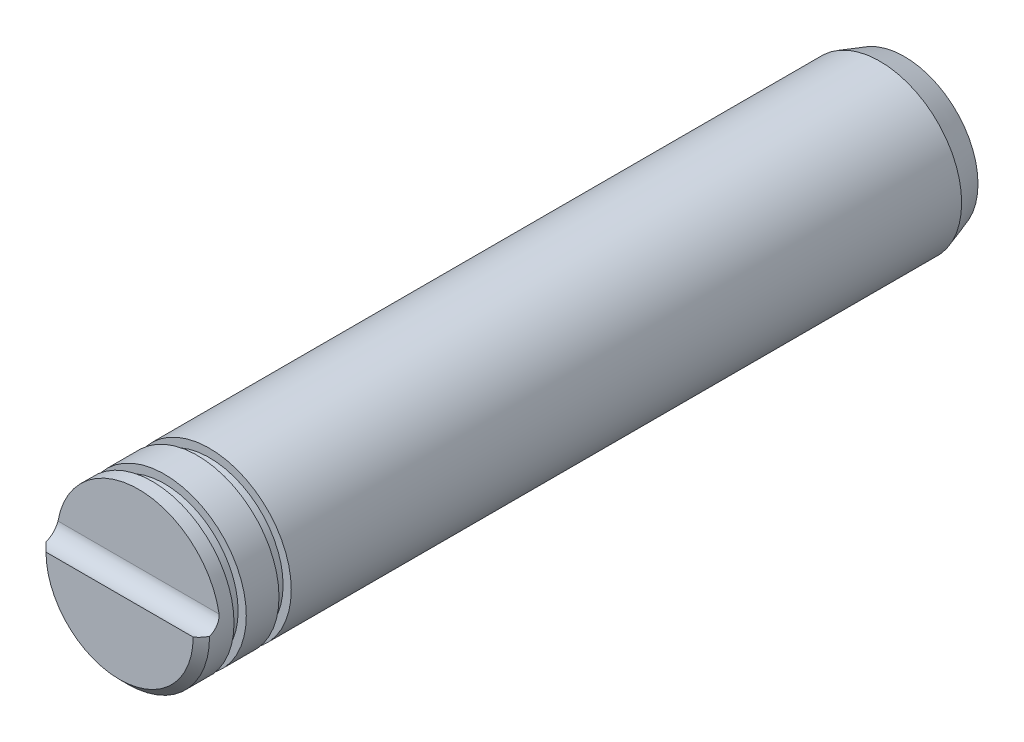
ISO-10303-21;
HEADER;
FILE_DESCRIPTION(('STEP AP214'),'2;1');
FILE_NAME('part.step','',(''),(''),'','','');
FILE_SCHEMA(('AUTOMOTIVE_DESIGN { 1 0 10303 214 1 1 1 1 }'));
ENDSEC;
DATA;
#1=APPLICATION_CONTEXT('core data for automotive mechanical design processes');
#2=APPLICATION_PROTOCOL_DEFINITION('international standard','automotive_design',2000,#1);
#3=PRODUCT_CONTEXT('',#1,'mechanical');
#4=PRODUCT('Part','Part','',(#3));
#5=PRODUCT_RELATED_PRODUCT_CATEGORY('part','',(#4));
#6=PRODUCT_DEFINITION_FORMATION('','',#4);
#7=PRODUCT_DEFINITION_CONTEXT('part definition',#1,'design');
#8=PRODUCT_DEFINITION('design','',#6,#7);
#9=PRODUCT_DEFINITION_SHAPE('','',#8);
#10=(LENGTH_UNIT() NAMED_UNIT(*) SI_UNIT(.MILLI.,.METRE.));
#11=(NAMED_UNIT(*) PLANE_ANGLE_UNIT() SI_UNIT($,.RADIAN.));
#12=(NAMED_UNIT(*) SI_UNIT($,.STERADIAN.) SOLID_ANGLE_UNIT());
#13=UNCERTAINTY_MEASURE_WITH_UNIT(LENGTH_MEASURE(1.E-05),#10,'distance_accuracy_value','');
#14=(GEOMETRIC_REPRESENTATION_CONTEXT(3) GLOBAL_UNCERTAINTY_ASSIGNED_CONTEXT((#13)) GLOBAL_UNIT_ASSIGNED_CONTEXT((#10,
#11,#12)) REPRESENTATION_CONTEXT('',''));
#15=CARTESIAN_POINT('',(0.,0.,0.));
#16=DIRECTION('',(0.,0.,1.));
#17=DIRECTION('',(1.,0.,0.));
#18=AXIS2_PLACEMENT_3D('',#15,#16,#17);
#19=CARTESIAN_POINT('',(0.,0.,96.));
#20=DIRECTION('',(0.,0.,-1.));
#21=DIRECTION('',(-1.,0.,0.));
#22=AXIS2_PLACEMENT_3D('',#19,#20,#21);
#23=CYLINDRICAL_SURFACE('',#22,10.);
#24=CARTESIAN_POINT('',(0.,0.,92.));
#25=DIRECTION('',(0.,0.,1.));
#26=DIRECTION('',(1.,0.,0.));
#27=AXIS2_PLACEMENT_3D('',#24,#25,#26);
#28=CIRCLE('',#27,10.);
#29=CARTESIAN_POINT('',(10.,0.,92.));
#30=VERTEX_POINT('',#29);
#31=EDGE_CURVE('E176',#30,#30,#28,.T.);
#32=ORIENTED_EDGE('',*,*,#31,.T.);
#33=EDGE_LOOP('',(#32));
#34=FACE_BOUND('',#33,.T.);
#35=CARTESIAN_POINT('',(9.99965835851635,0.0826602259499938,95.));
#36=CARTESIAN_POINT('',(9.99950345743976,0.101144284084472,94.9470807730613));
#37=CARTESIAN_POINT('',(9.99928327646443,0.121844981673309,94.8949641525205));
#38=CARTESIAN_POINT('',(9.99862297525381,0.167543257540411,94.7926531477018));
#39=CARTESIAN_POINT('',(9.99818286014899,0.192540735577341,94.7424587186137));
#40=CARTESIAN_POINT('',(9.99640009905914,0.27370415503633,94.5953593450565));
#41=CARTESIAN_POINT('',(9.99459509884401,0.336090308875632,94.5017978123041));
#42=CARTESIAN_POINT('',(9.9889265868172,0.475612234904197,94.326452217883));
#43=CARTESIAN_POINT('',(9.98506174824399,0.552757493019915,94.2446757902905));
#44=CARTESIAN_POINT('',(9.97443066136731,0.719509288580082,94.095268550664));
#45=CARTESIAN_POINT('',(9.96766545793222,0.809111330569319,94.0276326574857));
#46=CARTESIAN_POINT('',(9.95056303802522,0.997591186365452,93.9087143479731));
#47=CARTESIAN_POINT('',(9.94024517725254,1.09641666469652,93.8573461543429));
#48=CARTESIAN_POINT('',(9.91557002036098,1.30079063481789,93.7718040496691));
#49=CARTESIAN_POINT('',(9.9012121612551,1.4063400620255,93.7376325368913));
#50=CARTESIAN_POINT('',(9.86836964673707,1.62080961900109,93.6872784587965));
#51=CARTESIAN_POINT('',(9.8498924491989,1.72972335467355,93.6710636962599));
#52=CARTESIAN_POINT('',(9.80905882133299,1.9479980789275,93.6566306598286));
#53=CARTESIAN_POINT('',(9.786702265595,2.05735908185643,93.658412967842));
#54=CARTESIAN_POINT('',(9.73822505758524,2.27590972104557,93.6797889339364));
#55=CARTESIAN_POINT('',(9.71203489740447,2.3850469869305,93.6997578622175));
#56=CARTESIAN_POINT('',(9.65725468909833,2.59798631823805,93.7571746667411));
#57=CARTESIAN_POINT('',(9.62866419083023,2.70178737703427,93.7946258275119));
#58=CARTESIAN_POINT('',(9.56920836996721,2.90550304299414,93.8876676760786));
#59=CARTESIAN_POINT('',(9.53829781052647,3.00510679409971,93.9439106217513));
#60=CARTESIAN_POINT('',(9.47690107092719,3.19345848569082,94.0726303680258));
#61=CARTESIAN_POINT('',(9.44641517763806,3.28219937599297,94.1451176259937));
#62=CARTESIAN_POINT('',(9.38715749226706,3.44807134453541,94.3062295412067));
#63=CARTESIAN_POINT('',(9.35843278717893,3.52493157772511,94.3951506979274));
#64=CARTESIAN_POINT('',(9.30554160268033,3.66228345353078,94.5858854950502));
#65=CARTESIAN_POINT('',(9.28136483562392,3.7228121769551,94.6876691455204));
#66=CARTESIAN_POINT('',(9.25396996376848,3.79003126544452,94.827759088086));
#67=CARTESIAN_POINT('',(9.24776685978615,3.80513392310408,94.8616174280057));
#68=CARTESIAN_POINT('',(9.23606320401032,3.83345404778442,94.9301823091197));
#69=CARTESIAN_POINT('',(9.23056180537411,3.84667378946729,94.9648877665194));
#70=CARTESIAN_POINT('',(9.22543123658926,3.85894007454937,95.));
#71=B_SPLINE_CURVE_WITH_KNOTS('',3,(#35,#36,#37,#38,#39,#40,#41,#42,#43,#44,#45,#46,#47,#48,#49,
#50,#51,#52,#53,#54,#55,#56,#57,#58,#59,#60,#61,#62,#63,#64,#65,#66,#67,#68,#69,#70),
.UNSPECIFIED.,.F.,.F.,(4,2,2,2,2,2,2,2,2,2,2,2,2,2,2,2,2,4),(0.,0.168061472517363,
0.336119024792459,0.671793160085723,1.00768376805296,1.3434534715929,1.6774220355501,
2.01143716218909,2.34485241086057,2.67827844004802,3.01874434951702,3.35927425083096,
3.71312464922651,4.06720349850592,4.42843746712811,4.78884421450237,4.90156581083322,
5.01415005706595),.UNSPECIFIED.);
#72=CARTESIAN_POINT('',(9.99965835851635,0.0826602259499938,95.));
#73=VERTEX_POINT('',#72);
#74=CARTESIAN_POINT('',(9.85494799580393,1.69705627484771,93.6783129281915));
#75=VERTEX_POINT('',#74);
#76=EDGE_CURVE('E96',#73,#75,#71,.T.);
#77=ORIENTED_EDGE('',*,*,#76,.F.);
#78=CARTESIAN_POINT('',(0.,0.,95.));
#79=DIRECTION('',(0.,0.,1.));
#80=DIRECTION('',(1.,0.,0.));
#81=AXIS2_PLACEMENT_3D('',#78,#79,#80);
#82=CIRCLE('',#81,10.);
#83=CARTESIAN_POINT('',(-9.99965835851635,0.0826602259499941,95.));
#84=VERTEX_POINT('',#83);
#85=EDGE_CURVE('E68',#73,#84,#82,.F.);
#86=ORIENTED_EDGE('',*,*,#85,.T.);
#87=CARTESIAN_POINT('',(-9.22543123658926,3.85894007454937,95.));
#88=CARTESIAN_POINT('',(-9.23324629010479,3.84025190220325,94.9464937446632));
#89=CARTESIAN_POINT('',(-9.24192946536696,3.81933894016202,94.8939300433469));
#90=CARTESIAN_POINT('',(-9.2608324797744,3.77327591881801,94.7910089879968));
#91=CARTESIAN_POINT('',(-9.27105160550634,3.74812782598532,94.7406506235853));
#92=CARTESIAN_POINT('',(-9.30364760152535,3.66681569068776,94.5936453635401));
#93=CARTESIAN_POINT('',(-9.32802217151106,3.60464629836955,94.5006790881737));
#94=CARTESIAN_POINT('',(-9.38023701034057,3.46649494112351,94.3271226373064));
#95=CARTESIAN_POINT('',(-9.40807234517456,3.39053257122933,94.2465152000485));
#96=CARTESIAN_POINT('',(-9.46550978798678,3.22670986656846,94.0990939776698));
#97=CARTESIAN_POINT('',(-9.49511314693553,3.13884105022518,94.0322901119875));
#98=CARTESIAN_POINT('',(-9.5557937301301,2.94909502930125,93.9112992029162));
#99=CARTESIAN_POINT('',(-9.5868762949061,2.84676024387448,93.857831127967));
#100=CARTESIAN_POINT('',(-9.6474921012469,2.63403097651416,93.7691460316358));
#101=CARTESIAN_POINT('',(-9.6770253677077,2.52363662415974,93.7339287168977));
#102=CARTESIAN_POINT('',(-9.73330422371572,2.29705891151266,93.6828486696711));
#103=CARTESIAN_POINT('',(-9.7600332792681,2.18084659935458,93.6670954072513));
#104=CARTESIAN_POINT('',(-9.8094366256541,1.94660390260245,93.6562053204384));
#105=CARTESIAN_POINT('',(-9.83211185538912,1.82857394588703,93.6610637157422));
#106=CARTESIAN_POINT('',(-9.8720404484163,1.59872820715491,93.691115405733));
#107=CARTESIAN_POINT('',(-9.88946217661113,1.48684328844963,93.7155562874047));
#108=CARTESIAN_POINT('',(-9.9198505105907,1.26835740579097,93.7834172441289));
#109=CARTESIAN_POINT('',(-9.93281816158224,1.16175520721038,93.826832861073));
#110=CARTESIAN_POINT('',(-9.95426861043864,0.960457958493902,93.9298674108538));
#111=CARTESIAN_POINT('',(-9.9628789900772,0.865494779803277,93.9889371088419));
#112=CARTESIAN_POINT('',(-9.97680886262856,0.686551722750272,94.122235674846));
#113=CARTESIAN_POINT('',(-9.98212729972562,0.602575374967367,94.1964693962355));
#114=CARTESIAN_POINT('',(-9.99023623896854,0.448469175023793,94.3576086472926));
#115=CARTESIAN_POINT('',(-9.99303738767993,0.378281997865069,94.4444589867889));
#116=CARTESIAN_POINT('',(-9.99698524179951,0.253378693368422,94.6285699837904));
#117=CARTESIAN_POINT('',(-9.99813459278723,0.198637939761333,94.7258137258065));
#118=CARTESIAN_POINT('',(-9.99903631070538,0.139418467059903,94.8551158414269));
#119=CARTESIAN_POINT('',(-9.99919884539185,0.127110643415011,94.8837438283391));
#120=CARTESIAN_POINT('',(-9.99946738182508,0.103863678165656,94.9414984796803));
#121=CARTESIAN_POINT('',(-9.99957347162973,0.0929224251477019,94.9706242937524));
#122=CARTESIAN_POINT('',(-9.99965835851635,0.0826602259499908,95.));
#123=B_SPLINE_CURVE_WITH_KNOTS('',3,(#87,#88,#89,#90,#91,#92,#93,#94,#95,#96,#97,#98,#99,#100,
#101,#102,#103,#104,#105,#106,#107,#108,#109,#110,#111,#112,#113,#114,#115,#116,#117,#118,#119,
#120,#121,#122),.UNSPECIFIED.,.F.,.F.,(4,2,2,2,2,2,2,2,2,2,2,2,2,2,2,2,2,4),(0.,
0.171512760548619,0.342946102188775,0.684578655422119,1.02572961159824,1.367124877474,
1.72417403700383,2.0812174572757,2.44025995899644,2.79921919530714,3.14501194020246,
3.49072348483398,3.82562271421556,4.1606292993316,4.49421225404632,4.82726033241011,
4.92072446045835,5.01404234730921),.UNSPECIFIED.);
#124=CARTESIAN_POINT('',(-9.85494799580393,1.69705627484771,93.6783129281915));
#125=VERTEX_POINT('',#124);
#126=EDGE_CURVE('E45',#125,#84,#123,.T.);
#127=ORIENTED_EDGE('',*,*,#126,.F.);
#128=CARTESIAN_POINT('',(0.,0.,93.6783129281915));
#129=DIRECTION('',(0.,0.,1.));
#130=DIRECTION('',(1.,0.,0.));
#131=AXIS2_PLACEMENT_3D('',#128,#129,#130);
#132=CIRCLE('',#131,10.);
#133=EDGE_CURVE('E11',#75,#125,#132,.T.);
#134=ORIENTED_EDGE('',*,*,#133,.F.);
#135=EDGE_LOOP('',(#77,#86,#127,#134));
#136=FACE_BOUND('',#135,.T.);
#137=ADVANCED_FACE('F24',(#34,#136),#23,.T.);
#138=CARTESIAN_POINT('',(0.,0.,96.));
#139=DIRECTION('',(0.,0.,1.));
#140=DIRECTION('',(1.,0.,0.));
#141=AXIS2_PLACEMENT_3D('',#138,#139,#140);
#142=PLANE('',#141);
#143=CARTESIAN_POINT('',(0.,0.,96.));
#144=DIRECTION('',(0.,0.,1.));
#145=DIRECTION('',(1.,0.,0.));
#146=AXIS2_PLACEMENT_3D('',#143,#144,#145);
#147=CIRCLE('',#146,8.99999999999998);
#148=CARTESIAN_POINT('',(-9.,0.,96.));
#149=VERTEX_POINT('',#148);
#150=CARTESIAN_POINT('',(8.99999999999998,0.,96.));
#151=VERTEX_POINT('',#150);
#152=EDGE_CURVE('E64',#149,#151,#147,.T.);
#153=ORIENTED_EDGE('',*,*,#152,.T.);
#154=DIRECTION('',(-1.,0.,0.));
#155=VECTOR('',#154,1.);
#156=CARTESIAN_POINT('',(10.,0.,96.));
#157=LINE('',#156,#155);
#158=EDGE_CURVE('E39',#151,#149,#157,.T.);
#159=ORIENTED_EDGE('',*,*,#158,.T.);
#160=EDGE_LOOP('',(#153,#159));
#161=FACE_BOUND('',#160,.T.);
#162=ADVANCED_FACE('F63',(#161),#142,.T.);
#163=CARTESIAN_POINT('',(0.,0.,96.));
#164=DIRECTION('',(0.,0.,-1.));
#165=DIRECTION('',(-1.,0.,0.));
#166=AXIS2_PLACEMENT_3D('',#163,#164,#165);
#167=CONICAL_SURFACE('',#166,8.99999999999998,0.785398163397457);
#168=ORIENTED_EDGE('',*,*,#152,.F.);
#169=CARTESIAN_POINT('',(-8.99979999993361,3.45659155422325E-05,96.0002));
#170=CARTESIAN_POINT('',(-9.08346279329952,-0.0144046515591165,95.9165179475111));
#171=CARTESIAN_POINT('',(-9.16758126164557,-0.0234900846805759,95.8323845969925));
#172=CARTESIAN_POINT('',(-9.33538450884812,-0.030948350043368,95.6645695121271));
#173=CARTESIAN_POINT('',(-9.41906730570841,-0.0294070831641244,95.5808896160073));
#174=CARTESIAN_POINT('',(-9.58603204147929,-0.0158381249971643,95.413957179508));
#175=CARTESIAN_POINT('',(-9.66931395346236,-0.00380973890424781,95.3307046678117));
#176=CARTESIAN_POINT('',(-9.83535904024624,0.0311332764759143,95.1646031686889));
#177=CARTESIAN_POINT('',(-9.91811247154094,0.0541357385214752,95.081762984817));
#178=CARTESIAN_POINT('',(-9.99985778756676,0.0827300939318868,94.9998000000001));
#179=B_SPLINE_CURVE_WITH_KNOTS('',3,(#169,#170,#171,#172,#173,#174,#175,#176,#177,#178),
.UNSPECIFIED.,.F.,.F.,(4,2,2,2,4),(0.,0.357484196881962,0.712082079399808,1.06670345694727,
1.42421197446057),.UNSPECIFIED.);
#180=EDGE_CURVE('E32',#149,#84,#179,.T.);
#181=ORIENTED_EDGE('',*,*,#180,.T.);
#182=ORIENTED_EDGE('',*,*,#85,.F.);
#183=CARTESIAN_POINT('',(9.99985778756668,0.082730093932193,94.9998));
#184=CARTESIAN_POINT('',(9.91811247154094,0.0541357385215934,95.0817629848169));
#185=CARTESIAN_POINT('',(9.83535904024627,0.0311332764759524,95.1646031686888));
#186=CARTESIAN_POINT('',(9.6693139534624,-0.00380973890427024,95.3307046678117));
#187=CARTESIAN_POINT('',(9.58603204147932,-0.0158381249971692,95.413957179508));
#188=CARTESIAN_POINT('',(9.41906730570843,-0.029407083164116,95.5808896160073));
#189=CARTESIAN_POINT('',(9.33538450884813,-0.0309483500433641,95.6645695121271));
#190=CARTESIAN_POINT('',(9.16758126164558,-0.023490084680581,95.8323845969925));
#191=CARTESIAN_POINT('',(9.08346279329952,-0.0144046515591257,95.9165179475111));
#192=CARTESIAN_POINT('',(8.99979999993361,3.45659155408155E-05,96.0002));
#193=B_SPLINE_CURVE_WITH_KNOTS('',3,(#183,#184,#185,#186,#187,#188,#189,#190,#191,#192),
.UNSPECIFIED.,.F.,.F.,(4,2,2,2,4),(0.,0.35750851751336,0.712129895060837,1.06672777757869,
1.42421197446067),.UNSPECIFIED.);
#194=EDGE_CURVE('E60',#73,#151,#193,.T.);
#195=ORIENTED_EDGE('',*,*,#194,.T.);
#196=EDGE_LOOP('',(#168,#181,#182,#195));
#197=FACE_BOUND('',#196,.T.);
#198=ADVANCED_FACE('F67',(#197),#167,.T.);
#199=CARTESIAN_POINT('',(0.,0.,90.5));
#200=DIRECTION('',(0.,0.,1.));
#201=DIRECTION('',(1.,0.,0.));
#202=AXIS2_PLACEMENT_3D('',#199,#200,#201);
#203=PLANE('',#202);
#204=CARTESIAN_POINT('',(0.,0.,90.5));
#205=DIRECTION('',(0.,0.,1.));
#206=DIRECTION('',(1.,0.,0.));
#207=AXIS2_PLACEMENT_3D('',#204,#205,#206);
#208=CIRCLE('',#207,10.);
#209=CARTESIAN_POINT('',(10.,0.,90.5));
#210=VERTEX_POINT('',#209);
#211=EDGE_CURVE('E156',#210,#210,#208,.T.);
#212=ORIENTED_EDGE('',*,*,#211,.T.);
#213=EDGE_LOOP('',(#212));
#214=FACE_BOUND('',#213,.T.);
#215=CARTESIAN_POINT('',(0.,0.,90.5));
#216=DIRECTION('',(0.,0.,1.));
#217=DIRECTION('',(1.,0.,0.));
#218=AXIS2_PLACEMENT_3D('',#215,#216,#217);
#219=CIRCLE('',#218,9.);
#220=CARTESIAN_POINT('',(9.,0.,90.5));
#221=VERTEX_POINT('',#220);
#222=EDGE_CURVE('E174',#221,#221,#219,.T.);
#223=ORIENTED_EDGE('',*,*,#222,.F.);
#224=EDGE_LOOP('',(#223));
#225=FACE_BOUND('',#224,.T.);
#226=ADVANCED_FACE('F123',(#214,#225),#203,.T.);
#227=CARTESIAN_POINT('',(0.,0.,85.));
#228=DIRECTION('',(0.,0.,1.));
#229=DIRECTION('',(1.,0.,0.));
#230=AXIS2_PLACEMENT_3D('',#227,#228,#229);
#231=PLANE('',#230);
#232=CARTESIAN_POINT('',(0.,0.,85.));
#233=DIRECTION('',(0.,0.,1.));
#234=DIRECTION('',(1.,0.,0.));
#235=AXIS2_PLACEMENT_3D('',#232,#233,#234);
#236=CIRCLE('',#235,10.);
#237=CARTESIAN_POINT('',(10.,0.,85.));
#238=VERTEX_POINT('',#237);
#239=EDGE_CURVE('E150',#238,#238,#236,.T.);
#240=ORIENTED_EDGE('',*,*,#239,.T.);
#241=EDGE_LOOP('',(#240));
#242=FACE_BOUND('',#241,.T.);
#243=CARTESIAN_POINT('',(0.,0.,85.));
#244=DIRECTION('',(0.,0.,1.));
#245=DIRECTION('',(1.,0.,0.));
#246=AXIS2_PLACEMENT_3D('',#243,#244,#245);
#247=CIRCLE('',#246,9.);
#248=CARTESIAN_POINT('',(9.,0.,85.));
#249=VERTEX_POINT('',#248);
#250=EDGE_CURVE('E153',#249,#249,#247,.T.);
#251=ORIENTED_EDGE('',*,*,#250,.F.);
#252=EDGE_LOOP('',(#251));
#253=FACE_BOUND('',#252,.T.);
#254=ADVANCED_FACE('F126',(#242,#253),#231,.T.);
#255=CARTESIAN_POINT('',(0.,0.,85.));
#256=DIRECTION('',(0.,0.,-1.));
#257=DIRECTION('',(-1.,0.,0.));
#258=AXIS2_PLACEMENT_3D('',#255,#256,#257);
#259=CYLINDRICAL_SURFACE('',#258,10.);
#260=CARTESIAN_POINT('',(0.,0.,3.));
#261=DIRECTION('',(0.,0.,1.));
#262=DIRECTION('',(1.,0.,0.));
#263=AXIS2_PLACEMENT_3D('',#260,#261,#262);
#264=CIRCLE('',#263,10.);
#265=CARTESIAN_POINT('',(10.,0.,3.));
#266=VERTEX_POINT('',#265);
#267=EDGE_CURVE('E73',#266,#266,#264,.T.);
#268=ORIENTED_EDGE('',*,*,#267,.T.);
#269=EDGE_LOOP('',(#268));
#270=FACE_BOUND('',#269,.T.);
#271=ORIENTED_EDGE('',*,*,#239,.F.);
#272=EDGE_LOOP('',(#271));
#273=FACE_BOUND('',#272,.T.);
#274=ADVANCED_FACE('F26',(#270,#273),#259,.T.);
#275=CARTESIAN_POINT('',(0.,0.,0.));
#276=DIRECTION('',(0.,0.,1.));
#277=DIRECTION('',(1.,0.,0.));
#278=AXIS2_PLACEMENT_3D('',#275,#276,#277);
#279=PLANE('',#278);
#280=CARTESIAN_POINT('',(0.,0.,0.));
#281=DIRECTION('',(0.,0.,1.));
#282=DIRECTION('',(1.,0.,0.));
#283=AXIS2_PLACEMENT_3D('',#280,#281,#282);
#284=CIRCLE('',#283,9.);
#285=CARTESIAN_POINT('',(9.,0.,0.));
#286=VERTEX_POINT('',#285);
#287=EDGE_CURVE('E69',#286,#286,#284,.F.);
#288=ORIENTED_EDGE('',*,*,#287,.T.);
#289=EDGE_LOOP('',(#288));
#290=FACE_BOUND('',#289,.T.);
#291=ADVANCED_FACE('F137',(#290),#279,.F.);
#292=CARTESIAN_POINT('',(0.,0.,3.));
#293=DIRECTION('',(0.,0.,1.));
#294=DIRECTION('',(1.,0.,0.));
#295=AXIS2_PLACEMENT_3D('',#292,#293,#294);
#296=CONICAL_SURFACE('',#295,10.,0.321750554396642);
#297=ORIENTED_EDGE('',*,*,#287,.F.);
#298=EDGE_LOOP('',(#297));
#299=FACE_BOUND('',#298,.T.);
#300=ORIENTED_EDGE('',*,*,#267,.F.);
#301=EDGE_LOOP('',(#300));
#302=FACE_BOUND('',#301,.T.);
#303=ADVANCED_FACE('F133',(#299,#302),#296,.T.);
#304=CARTESIAN_POINT('',(0.,0.,86.5));
#305=DIRECTION('',(0.,0.,-1.));
#306=DIRECTION('',(-1.,0.,0.));
#307=AXIS2_PLACEMENT_3D('',#304,#305,#306);
#308=CYLINDRICAL_SURFACE('',#307,9.);
#309=CARTESIAN_POINT('',(0.,0.,86.5));
#310=DIRECTION('',(0.,0.,1.));
#311=DIRECTION('',(1.,0.,0.));
#312=AXIS2_PLACEMENT_3D('',#309,#310,#311);
#313=CIRCLE('',#312,9.);
#314=CARTESIAN_POINT('',(9.,0.,86.5));
#315=VERTEX_POINT('',#314);
#316=EDGE_CURVE('E155',#315,#315,#313,.T.);
#317=ORIENTED_EDGE('',*,*,#316,.F.);
#318=EDGE_LOOP('',(#317));
#319=FACE_BOUND('',#318,.T.);
#320=ORIENTED_EDGE('',*,*,#250,.T.);
#321=EDGE_LOOP('',(#320));
#322=FACE_BOUND('',#321,.T.);
#323=ADVANCED_FACE('F121',(#319,#322),#308,.T.);
#324=CARTESIAN_POINT('',(0.,0.,86.5));
#325=DIRECTION('',(0.,0.,1.));
#326=DIRECTION('',(1.,0.,0.));
#327=AXIS2_PLACEMENT_3D('',#324,#325,#326);
#328=PLANE('',#327);
#329=CARTESIAN_POINT('',(0.,0.,86.5));
#330=DIRECTION('',(0.,0.,1.));
#331=DIRECTION('',(1.,0.,0.));
#332=AXIS2_PLACEMENT_3D('',#329,#330,#331);
#333=CIRCLE('',#332,10.);
#334=CARTESIAN_POINT('',(10.,0.,86.5));
#335=VERTEX_POINT('',#334);
#336=EDGE_CURVE('E161',#335,#335,#333,.T.);
#337=ORIENTED_EDGE('',*,*,#336,.F.);
#338=EDGE_LOOP('',(#337));
#339=FACE_BOUND('',#338,.T.);
#340=ORIENTED_EDGE('',*,*,#316,.T.);
#341=EDGE_LOOP('',(#340));
#342=FACE_BOUND('',#341,.T.);
#343=ADVANCED_FACE('F118',(#339,#342),#328,.F.);
#344=CARTESIAN_POINT('',(0.,0.,90.5));
#345=DIRECTION('',(0.,0.,-1.));
#346=DIRECTION('',(-1.,0.,0.));
#347=AXIS2_PLACEMENT_3D('',#344,#345,#346);
#348=CYLINDRICAL_SURFACE('',#347,10.);
#349=ORIENTED_EDGE('',*,*,#211,.F.);
#350=EDGE_LOOP('',(#349));
#351=FACE_BOUND('',#350,.T.);
#352=ORIENTED_EDGE('',*,*,#336,.T.);
#353=EDGE_LOOP('',(#352));
#354=FACE_BOUND('',#353,.T.);
#355=ADVANCED_FACE('F116',(#351,#354),#348,.T.);
#356=CARTESIAN_POINT('',(0.,0.,92.));
#357=DIRECTION('',(0.,0.,-1.));
#358=DIRECTION('',(-1.,0.,0.));
#359=AXIS2_PLACEMENT_3D('',#356,#357,#358);
#360=CYLINDRICAL_SURFACE('',#359,9.);
#361=CARTESIAN_POINT('',(0.,0.,92.));
#362=DIRECTION('',(0.,0.,1.));
#363=DIRECTION('',(1.,0.,0.));
#364=AXIS2_PLACEMENT_3D('',#361,#362,#363);
#365=CIRCLE('',#364,9.);
#366=CARTESIAN_POINT('',(9.,0.,92.));
#367=VERTEX_POINT('',#366);
#368=EDGE_CURVE('E171',#367,#367,#365,.T.);
#369=ORIENTED_EDGE('',*,*,#368,.F.);
#370=EDGE_LOOP('',(#369));
#371=FACE_BOUND('',#370,.T.);
#372=ORIENTED_EDGE('',*,*,#222,.T.);
#373=EDGE_LOOP('',(#372));
#374=FACE_BOUND('',#373,.T.);
#375=ADVANCED_FACE('F111',(#371,#374),#360,.T.);
#376=CARTESIAN_POINT('',(0.,0.,92.));
#377=DIRECTION('',(0.,0.,1.));
#378=DIRECTION('',(1.,0.,0.));
#379=AXIS2_PLACEMENT_3D('',#376,#377,#378);
#380=PLANE('',#379);
#381=ORIENTED_EDGE('',*,*,#31,.F.);
#382=EDGE_LOOP('',(#381));
#383=FACE_BOUND('',#382,.T.);
#384=ORIENTED_EDGE('',*,*,#368,.T.);
#385=EDGE_LOOP('',(#384));
#386=FACE_BOUND('',#385,.T.);
#387=ADVANCED_FACE('F115',(#383,#386),#380,.F.);
#388=CARTESIAN_POINT('',(10.,1.69705627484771,93.6783129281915));
#389=DIRECTION('',(0.,0.,1.));
#390=DIRECTION('',(1.,0.,0.));
#391=AXIS2_PLACEMENT_3D('',#388,#389,#390);
#392=PLANE('',#391);
#393=ORIENTED_EDGE('',*,*,#133,.T.);
#394=DIRECTION('',(-1.,0.,0.));
#395=VECTOR('',#394,1.);
#396=CARTESIAN_POINT('',(10.,1.69705627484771,93.6783129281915));
#397=LINE('',#396,#395);
#398=EDGE_CURVE('E65',#75,#125,#397,.T.);
#399=ORIENTED_EDGE('',*,*,#398,.F.);
#400=EDGE_LOOP('',(#393,#399));
#401=FACE_BOUND('',#400,.T.);
#402=ADVANCED_FACE('F90',(#401),#392,.T.);
#403=CARTESIAN_POINT('',(10.,1.97080015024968,95.6594904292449));
#404=DIRECTION('',(-1.,0.,0.));
#405=DIRECTION('',(0.,0.,1.));
#406=AXIS2_PLACEMENT_3D('',#403,#404,#405);
#407=CYLINDRICAL_SURFACE('',#406,2.);
#408=ORIENTED_EDGE('',*,*,#126,.T.);
#409=ORIENTED_EDGE('',*,*,#180,.F.);
#410=ORIENTED_EDGE('',*,*,#158,.F.);
#411=ORIENTED_EDGE('',*,*,#194,.F.);
#412=ORIENTED_EDGE('',*,*,#76,.T.);
#413=ORIENTED_EDGE('',*,*,#398,.T.);
#414=EDGE_LOOP('',(#408,#409,#410,#411,#412,#413));
#415=FACE_BOUND('',#414,.T.);
#416=ADVANCED_FACE('F55',(#415),#407,.F.);
#417=CLOSED_SHELL('',(#137,#162,#198,#226,#254,#274,#291,#303,#323,#343,#355,#375,#387,#402,#416));
#418=MANIFOLD_SOLID_BREP('B2',#417);
#419=ADVANCED_BREP_SHAPE_REPRESENTATION('',(#18,#418),#14);
#420=SHAPE_DEFINITION_REPRESENTATION(#9,#419);
ENDSEC;
END-ISO-10303-21;
